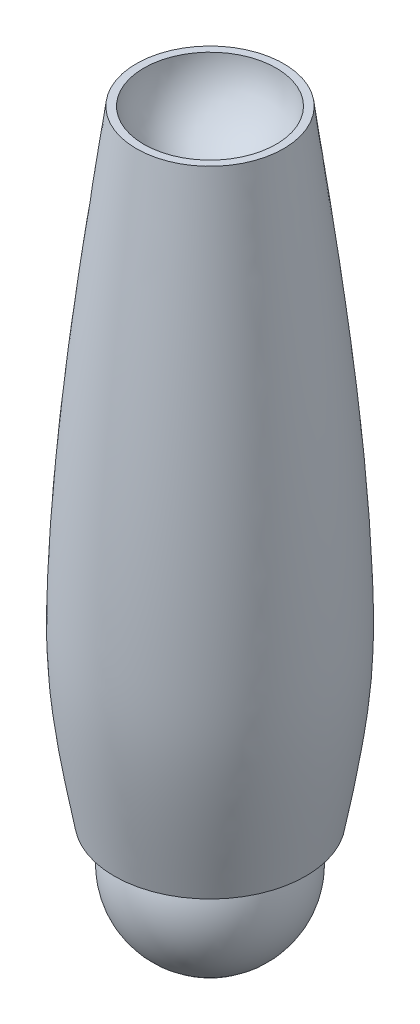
ISO-10303-21;
HEADER;
FILE_DESCRIPTION(('STEP AP214'),'2;1');
FILE_NAME('part.step','',(''),(''),'','','');
FILE_SCHEMA(('AUTOMOTIVE_DESIGN { 1 0 10303 214 1 1 1 1 }'));
ENDSEC;
DATA;
#1=APPLICATION_CONTEXT('core data for automotive mechanical design processes');
#2=APPLICATION_PROTOCOL_DEFINITION('international standard','automotive_design',2000,#1);
#3=PRODUCT_CONTEXT('',#1,'mechanical');
#4=PRODUCT('Part','Part','',(#3));
#5=PRODUCT_RELATED_PRODUCT_CATEGORY('part','',(#4));
#6=PRODUCT_DEFINITION_FORMATION('','',#4);
#7=PRODUCT_DEFINITION_CONTEXT('part definition',#1,'design');
#8=PRODUCT_DEFINITION('design','',#6,#7);
#9=PRODUCT_DEFINITION_SHAPE('','',#8);
#10=(LENGTH_UNIT() NAMED_UNIT(*) SI_UNIT(.MILLI.,.METRE.));
#11=(NAMED_UNIT(*) PLANE_ANGLE_UNIT() SI_UNIT($,.RADIAN.));
#12=(NAMED_UNIT(*) SI_UNIT($,.STERADIAN.) SOLID_ANGLE_UNIT());
#13=UNCERTAINTY_MEASURE_WITH_UNIT(LENGTH_MEASURE(1.E-05),#10,'distance_accuracy_value','');
#14=(GEOMETRIC_REPRESENTATION_CONTEXT(3) GLOBAL_UNCERTAINTY_ASSIGNED_CONTEXT((#13)) GLOBAL_UNIT_ASSIGNED_CONTEXT((#10,
#11,#12)) REPRESENTATION_CONTEXT('',''));
#15=CARTESIAN_POINT('',(0.,0.,0.));
#16=DIRECTION('',(0.,0.,1.));
#17=DIRECTION('',(1.,0.,0.));
#18=AXIS2_PLACEMENT_3D('',#15,#16,#17);
#19=CARTESIAN_POINT('',(-30.0000000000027,252.000000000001,0.));
#20=DIRECTION('',(0.,1.,0.));
#21=DIRECTION('',(0.,0.,1.));
#22=AXIS2_PLACEMENT_3D('',#19,#20,#21);
#23=PLANE('',#22);
#24=CARTESIAN_POINT('',(-1.33226762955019E-12,252.000000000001,0.));
#25=DIRECTION('',(0.,1.,0.));
#26=DIRECTION('',(0.,0.,1.));
#27=AXIS2_PLACEMENT_3D('',#24,#25,#26);
#28=CIRCLE('',#27,26.9258240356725);
#29=CARTESIAN_POINT('',(-1.32853092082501E-12,252.000000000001,26.9258240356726));
#30=VERTEX_POINT('',#29);
#31=EDGE_CURVE('E39',#30,#30,#28,.T.);
#32=ORIENTED_EDGE('',*,*,#31,.F.);
#33=EDGE_LOOP('',(#32));
#34=FACE_BOUND('',#33,.T.);
#35=CARTESIAN_POINT('',(-1.33226762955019E-12,252.000000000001,0.));
#36=DIRECTION('',(0.,1.,0.));
#37=DIRECTION('',(0.,0.,1.));
#38=AXIS2_PLACEMENT_3D('',#35,#36,#37);
#39=CIRCLE('',#38,30.);
#40=CARTESIAN_POINT('',(-1.32810429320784E-12,252.000000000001,30.0000000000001));
#41=VERTEX_POINT('',#40);
#42=EDGE_CURVE('E43',#41,#41,#39,.T.);
#43=ORIENTED_EDGE('',*,*,#42,.T.);
#44=EDGE_LOOP('',(#43));
#45=FACE_BOUND('',#44,.T.);
#46=ADVANCED_FACE('F36',(#34,#45),#23,.T.);
#47=CARTESIAN_POINT('',(-30.0000000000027,252.000000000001,0.));
#48=CARTESIAN_POINT('',(-33.1362765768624,228.628472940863,0.));
#49=CARTESIAN_POINT('',(-40.6662708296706,172.514970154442,0.));
#50=CARTESIAN_POINT('',(-46.6177957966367,107.610601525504,0.));
#51=CARTESIAN_POINT('',(-47.5077610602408,46.6076875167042,0.));
#52=CARTESIAN_POINT('',(-42.4862643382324,19.0986462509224,0.));
#53=CARTESIAN_POINT('',(-38.9999999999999,0.,0.));
#54=B_SPLINE_CURVE_WITH_KNOTS('',3,(#47,#48,#49,#50,#51,#52,#53),.UNSPECIFIED.,.F.,.F.,(4,1,1,1,
4),(0.,0.279151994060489,0.670225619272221,0.771048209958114,1.),.UNSPECIFIED.);
#55=CARTESIAN_POINT('',(-1.33226762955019E-12,252.000000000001,0.));
#56=DIRECTION('',(0.,1.,0.));
#57=AXIS1_PLACEMENT('',#55,#56);
#58=SURFACE_OF_REVOLUTION('',#54,#57);
#59=CARTESIAN_POINT('',(0.,0.,0.));
#60=DIRECTION('',(0.,1.,0.));
#61=DIRECTION('',(0.,0.,1.));
#62=AXIS2_PLACEMENT_3D('',#59,#60,#61);
#63=CIRCLE('',#62,39.);
#64=CARTESIAN_POINT('',(0.,0.,39.0000000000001));
#65=VERTEX_POINT('',#64);
#66=EDGE_CURVE('E47',#65,#65,#63,.T.);
#67=ORIENTED_EDGE('',*,*,#66,.T.);
#68=EDGE_LOOP('',(#67));
#69=FACE_BOUND('',#68,.T.);
#70=ORIENTED_EDGE('',*,*,#42,.F.);
#71=EDGE_LOOP('',(#70));
#72=FACE_BOUND('',#71,.T.);
#73=ADVANCED_FACE('F58',(#69,#72),#58,.F.);
#74=CARTESIAN_POINT('',(0.,0.,0.));
#75=DIRECTION('',(0.,-1.,0.));
#76=DIRECTION('',(0.,0.,-1.));
#77=AXIS2_PLACEMENT_3D('',#74,#75,#76);
#78=PLANE('',#77);
#79=CARTESIAN_POINT('',(0.,0.,0.));
#80=DIRECTION('',(0.,-1.,0.));
#81=DIRECTION('',(0.,0.,-1.));
#82=AXIS2_PLACEMENT_3D('',#79,#80,#81);
#83=CIRCLE('',#82,29.3938769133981);
#84=CARTESIAN_POINT('',(0.,0.,-29.3938769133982));
#85=VERTEX_POINT('',#84);
#86=EDGE_CURVE('E10',#85,#85,#83,.T.);
#87=ORIENTED_EDGE('',*,*,#86,.F.);
#88=EDGE_LOOP('',(#87));
#89=FACE_BOUND('',#88,.T.);
#90=ORIENTED_EDGE('',*,*,#66,.F.);
#91=EDGE_LOOP('',(#90));
#92=FACE_BOUND('',#91,.T.);
#93=ADVANCED_FACE('F61',(#89,#92),#78,.T.);
#94=CARTESIAN_POINT('',(-2.22044604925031E-13,-15.0000000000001,2.77555756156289E-13));
#95=DIRECTION('',(0.,-1.,0.));
#96=DIRECTION('',(-1.,0.,0.));
#97=AXIS2_PLACEMENT_3D('',#94,#95,#96);
#98=SPHERICAL_SURFACE('',#97,33.);
#99=ORIENTED_EDGE('',*,*,#86,.T.);
#100=EDGE_LOOP('',(#99));
#101=FACE_BOUND('',#100,.T.);
#102=ADVANCED_FACE('F65',(#101),#98,.T.);
#103=CARTESIAN_POINT('',(-1.33226762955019E-12,254.000000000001,0.));
#104=DIRECTION('',(0.,-1.,0.));
#105=DIRECTION('',(-1.,0.,0.));
#106=AXIS2_PLACEMENT_3D('',#103,#104,#105);
#107=SPHERICAL_SURFACE('',#106,27.);
#108=ORIENTED_EDGE('',*,*,#31,.T.);
#109=EDGE_LOOP('',(#108));
#110=FACE_BOUND('',#109,.T.);
#111=ADVANCED_FACE('F69',(#110),#107,.F.);
#112=CLOSED_SHELL('',(#46,#73,#93,#102,#111));
#113=MANIFOLD_SOLID_BREP('B2',#112);
#114=ADVANCED_BREP_SHAPE_REPRESENTATION('',(#18,#113),#14);
#115=SHAPE_DEFINITION_REPRESENTATION(#9,#114);
ENDSEC;
END-ISO-10303-21;
